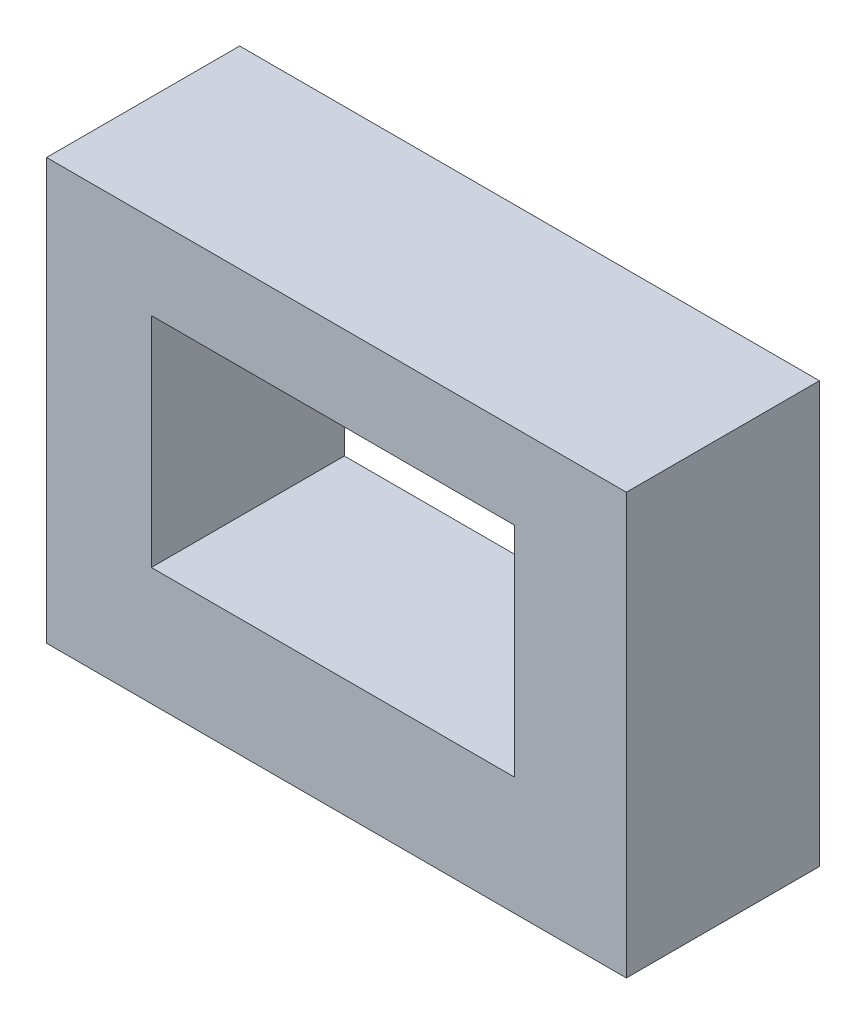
from build123d import *

# Parameters (mm, degrees)
SKETCH1_W          = 49.580976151
SKETCH1_H          = 35.977990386
EXTRUDE1_DEPTH     = 16.51
SKETCH2_W          = 31.043007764
SKETCH2_H          = 18.657196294
CUT_EXTRUDE1_DEPTH = 64.44500838


with BuildPart() as part:
    # Sketch1 → Extrude1 (new body)
    with BuildSketch(Plane.XY):
        with Locations((24.790488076, 17.988995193)):
            Rectangle(SKETCH1_W, SKETCH1_H)
    extrude(amount=EXTRUDE1_DEPTH)

    # Sketch2 → Cut-Extrude1 (cut, through all)
    with BuildSketch(Plane.XY.offset(16.51)):
        with Locations((24.478746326, 19.421641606)):
            Rectangle(SKETCH2_W, SKETCH2_H)
    extrude(amount=-CUT_EXTRUDE1_DEPTH, mode=Mode.SUBTRACT)


solid = part.part
